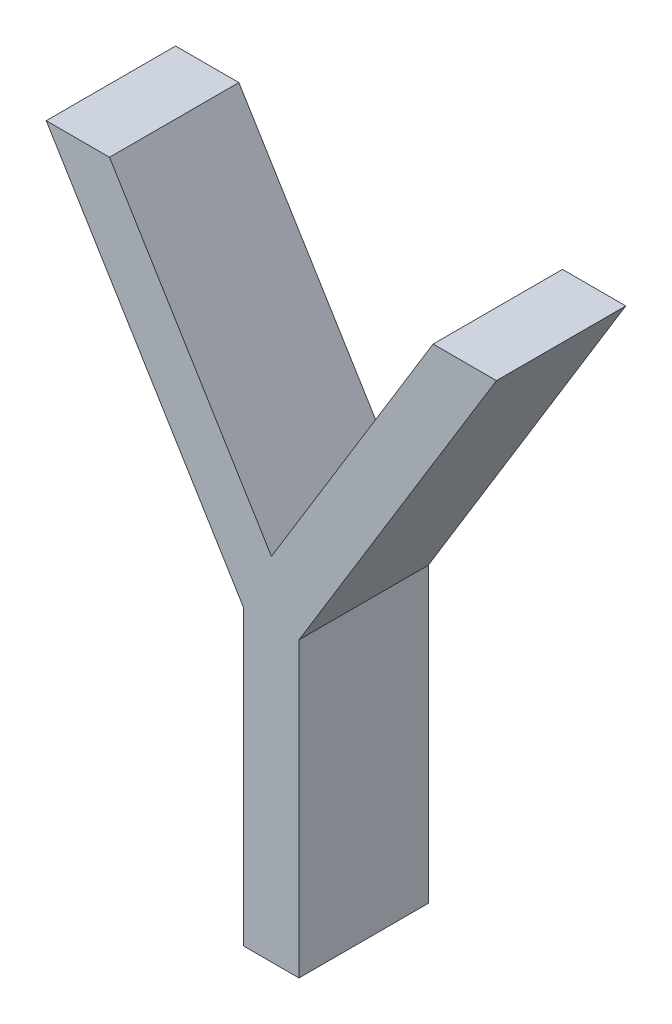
ISO-10303-21;
HEADER;
FILE_DESCRIPTION(('STEP AP214'),'2;1');
FILE_NAME('part.step','',(''),(''),'','','');
FILE_SCHEMA(('AUTOMOTIVE_DESIGN { 1 0 10303 214 1 1 1 1 }'));
ENDSEC;
DATA;
#1=APPLICATION_CONTEXT('core data for automotive mechanical design processes');
#2=APPLICATION_PROTOCOL_DEFINITION('international standard','automotive_design',2000,#1);
#3=PRODUCT_CONTEXT('',#1,'mechanical');
#4=PRODUCT('Part','Part','',(#3));
#5=PRODUCT_RELATED_PRODUCT_CATEGORY('part','',(#4));
#6=PRODUCT_DEFINITION_FORMATION('','',#4);
#7=PRODUCT_DEFINITION_CONTEXT('part definition',#1,'design');
#8=PRODUCT_DEFINITION('design','',#6,#7);
#9=PRODUCT_DEFINITION_SHAPE('','',#8);
#10=(LENGTH_UNIT() NAMED_UNIT(*) SI_UNIT(.MILLI.,.METRE.));
#11=(NAMED_UNIT(*) PLANE_ANGLE_UNIT() SI_UNIT($,.RADIAN.));
#12=(NAMED_UNIT(*) SI_UNIT($,.STERADIAN.) SOLID_ANGLE_UNIT());
#13=UNCERTAINTY_MEASURE_WITH_UNIT(LENGTH_MEASURE(1.E-05),#10,'distance_accuracy_value','');
#14=(GEOMETRIC_REPRESENTATION_CONTEXT(3) GLOBAL_UNCERTAINTY_ASSIGNED_CONTEXT((#13)) GLOBAL_UNIT_ASSIGNED_CONTEXT((#10,
#11,#12)) REPRESENTATION_CONTEXT('',''));
#15=CARTESIAN_POINT('',(0.,0.,0.));
#16=DIRECTION('',(0.,0.,1.));
#17=DIRECTION('',(1.,0.,0.));
#18=AXIS2_PLACEMENT_3D('',#15,#16,#17);
#19=CARTESIAN_POINT('',(192.216794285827,19.3797409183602,2.));
#20=DIRECTION('',(-0.853354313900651,-0.521331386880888,0.));
#21=DIRECTION('',(0.521331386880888,-0.853354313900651,0.));
#22=AXIS2_PLACEMENT_3D('',#19,#20,#21);
#23=PLANE('',#22);
#24=DIRECTION('',(-0.521331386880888,0.853354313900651,0.));
#25=VECTOR('',#24,1.);
#26=CARTESIAN_POINT('',(192.216794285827,19.3797409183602,-2.));
#27=LINE('',#26,#25);
#28=CARTESIAN_POINT('',(192.216794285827,19.3797409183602,-2.));
#29=VERTEX_POINT('',#28);
#30=CARTESIAN_POINT('',(186.111025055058,29.3741219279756,-2.));
#31=VERTEX_POINT('',#30);
#32=EDGE_CURVE('E133',#29,#31,#27,.T.);
#33=ORIENTED_EDGE('',*,*,#32,.F.);
#34=DIRECTION('',(0.,0.,-1.));
#35=VECTOR('',#34,1.);
#36=CARTESIAN_POINT('',(192.216794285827,19.3797409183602,2.));
#37=LINE('',#36,#35);
#38=CARTESIAN_POINT('',(192.216794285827,19.3797409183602,2.));
#39=VERTEX_POINT('',#38);
#40=EDGE_CURVE('E11',#39,#29,#37,.T.);
#41=ORIENTED_EDGE('',*,*,#40,.F.);
#42=DIRECTION('',(-0.521331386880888,0.853354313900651,0.));
#43=VECTOR('',#42,1.);
#44=CARTESIAN_POINT('',(192.216794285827,19.3797409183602,2.));
#45=LINE('',#44,#43);
#46=CARTESIAN_POINT('',(186.111025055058,29.3741219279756,2.));
#47=VERTEX_POINT('',#46);
#48=EDGE_CURVE('E156',#39,#47,#45,.T.);
#49=ORIENTED_EDGE('',*,*,#48,.T.);
#50=DIRECTION('',(0.,0.,-1.));
#51=VECTOR('',#50,1.);
#52=CARTESIAN_POINT('',(186.111025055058,29.3741219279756,2.));
#53=LINE('',#52,#51);
#54=EDGE_CURVE('E33',#47,#31,#53,.T.);
#55=ORIENTED_EDGE('',*,*,#54,.T.);
#56=EDGE_LOOP('',(#33,#41,#49,#55));
#57=FACE_BOUND('',#56,.T.);
#58=ADVANCED_FACE('F30',(#57),#23,.T.);
#59=CARTESIAN_POINT('',(192.216794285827,10.3241219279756,2.));
#60=DIRECTION('',(-1.,0.,0.));
#61=DIRECTION('',(0.,0.,1.));
#62=AXIS2_PLACEMENT_3D('',#59,#60,#61);
#63=PLANE('',#62);
#64=DIRECTION('',(0.,1.,0.));
#65=VECTOR('',#64,1.);
#66=CARTESIAN_POINT('',(192.216794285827,10.3241219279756,-2.));
#67=LINE('',#66,#65);
#68=CARTESIAN_POINT('',(192.216794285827,10.3241219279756,-2.));
#69=VERTEX_POINT('',#68);
#70=EDGE_CURVE('E154',#69,#29,#67,.T.);
#71=ORIENTED_EDGE('',*,*,#70,.F.);
#72=DIRECTION('',(0.,0.,-1.));
#73=VECTOR('',#72,1.);
#74=CARTESIAN_POINT('',(192.216794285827,10.3241219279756,2.));
#75=LINE('',#74,#73);
#76=CARTESIAN_POINT('',(192.216794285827,10.3241219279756,2.));
#77=VERTEX_POINT('',#76);
#78=EDGE_CURVE('E39',#77,#69,#75,.T.);
#79=ORIENTED_EDGE('',*,*,#78,.F.);
#80=DIRECTION('',(0.,1.,0.));
#81=VECTOR('',#80,1.);
#82=CARTESIAN_POINT('',(192.216794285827,10.3241219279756,2.));
#83=LINE('',#82,#81);
#84=EDGE_CURVE('E123',#77,#39,#83,.T.);
#85=ORIENTED_EDGE('',*,*,#84,.T.);
#86=ORIENTED_EDGE('',*,*,#40,.T.);
#87=EDGE_LOOP('',(#71,#79,#85,#86));
#88=FACE_BOUND('',#87,.T.);
#89=ADVANCED_FACE('F170',(#88),#63,.T.);
#90=CARTESIAN_POINT('',(193.926409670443,10.3241219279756,2.));
#91=DIRECTION('',(0.,-1.,0.));
#92=DIRECTION('',(0.,0.,-1.));
#93=AXIS2_PLACEMENT_3D('',#90,#91,#92);
#94=PLANE('',#93);
#95=DIRECTION('',(-1.,0.,0.));
#96=VECTOR('',#95,1.);
#97=CARTESIAN_POINT('',(193.926409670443,10.3241219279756,-2.));
#98=LINE('',#97,#96);
#99=CARTESIAN_POINT('',(193.926409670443,10.3241219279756,-2.));
#100=VERTEX_POINT('',#99);
#101=EDGE_CURVE('E110',#100,#69,#98,.T.);
#102=ORIENTED_EDGE('',*,*,#101,.F.);
#103=DIRECTION('',(0.,0.,-1.));
#104=VECTOR('',#103,1.);
#105=CARTESIAN_POINT('',(193.926409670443,10.3241219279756,2.));
#106=LINE('',#105,#104);
#107=CARTESIAN_POINT('',(193.926409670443,10.3241219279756,2.));
#108=VERTEX_POINT('',#107);
#109=EDGE_CURVE('E105',#108,#100,#106,.T.);
#110=ORIENTED_EDGE('',*,*,#109,.F.);
#111=DIRECTION('',(-1.,0.,0.));
#112=VECTOR('',#111,1.);
#113=CARTESIAN_POINT('',(193.926409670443,10.3241219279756,2.));
#114=LINE('',#113,#112);
#115=EDGE_CURVE('E108',#108,#77,#114,.T.);
#116=ORIENTED_EDGE('',*,*,#115,.T.);
#117=ORIENTED_EDGE('',*,*,#78,.T.);
#118=EDGE_LOOP('',(#102,#110,#116,#117));
#119=FACE_BOUND('',#118,.T.);
#120=ADVANCED_FACE('F107',(#119),#94,.T.);
#121=CARTESIAN_POINT('',(193.926409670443,19.3797409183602,2.));
#122=DIRECTION('',(1.,0.,0.));
#123=DIRECTION('',(0.,0.,-1.));
#124=AXIS2_PLACEMENT_3D('',#121,#122,#123);
#125=PLANE('',#124);
#126=DIRECTION('',(0.,-1.,0.));
#127=VECTOR('',#126,1.);
#128=CARTESIAN_POINT('',(193.926409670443,19.3797409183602,-2.));
#129=LINE('',#128,#127);
#130=CARTESIAN_POINT('',(193.926409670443,19.3797409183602,-2.));
#131=VERTEX_POINT('',#130);
#132=EDGE_CURVE('E151',#131,#100,#129,.T.);
#133=ORIENTED_EDGE('',*,*,#132,.F.);
#134=DIRECTION('',(0.,0.,-1.));
#135=VECTOR('',#134,1.);
#136=CARTESIAN_POINT('',(193.926409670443,19.3797409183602,2.));
#137=LINE('',#136,#135);
#138=CARTESIAN_POINT('',(193.926409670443,19.3797409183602,2.));
#139=VERTEX_POINT('',#138);
#140=EDGE_CURVE('E115',#139,#131,#137,.T.);
#141=ORIENTED_EDGE('',*,*,#140,.F.);
#142=DIRECTION('',(0.,-1.,0.));
#143=VECTOR('',#142,1.);
#144=CARTESIAN_POINT('',(193.926409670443,19.3797409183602,2.));
#145=LINE('',#144,#143);
#146=EDGE_CURVE('E121',#139,#108,#145,.T.);
#147=ORIENTED_EDGE('',*,*,#146,.T.);
#148=ORIENTED_EDGE('',*,*,#109,.T.);
#149=EDGE_LOOP('',(#133,#141,#147,#148));
#150=FACE_BOUND('',#149,.T.);
#151=ADVANCED_FACE('F125',(#150),#125,.T.);
#152=CARTESIAN_POINT('',(200.032178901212,29.3741219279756,2.));
#153=DIRECTION('',(0.853354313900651,-0.521331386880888,0.));
#154=DIRECTION('',(0.521331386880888,0.853354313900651,0.));
#155=AXIS2_PLACEMENT_3D('',#152,#153,#154);
#156=PLANE('',#155);
#157=DIRECTION('',(-0.521331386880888,-0.853354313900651,0.));
#158=VECTOR('',#157,1.);
#159=CARTESIAN_POINT('',(200.032178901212,29.3741219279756,-2.));
#160=LINE('',#159,#158);
#161=CARTESIAN_POINT('',(200.032178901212,29.3741219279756,-2.));
#162=VERTEX_POINT('',#161);
#163=EDGE_CURVE('E148',#162,#131,#160,.T.);
#164=ORIENTED_EDGE('',*,*,#163,.F.);
#165=DIRECTION('',(0.,0.,-1.));
#166=VECTOR('',#165,1.);
#167=CARTESIAN_POINT('',(200.032178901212,29.3741219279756,2.));
#168=LINE('',#167,#166);
#169=CARTESIAN_POINT('',(200.032178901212,29.3741219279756,2.));
#170=VERTEX_POINT('',#169);
#171=EDGE_CURVE('E160',#170,#162,#168,.T.);
#172=ORIENTED_EDGE('',*,*,#171,.F.);
#173=DIRECTION('',(-0.521331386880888,-0.853354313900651,0.));
#174=VECTOR('',#173,1.);
#175=CARTESIAN_POINT('',(200.032178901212,29.3741219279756,2.));
#176=LINE('',#175,#174);
#177=EDGE_CURVE('E126',#170,#139,#176,.T.);
#178=ORIENTED_EDGE('',*,*,#177,.T.);
#179=ORIENTED_EDGE('',*,*,#140,.T.);
#180=EDGE_LOOP('',(#164,#172,#178,#179));
#181=FACE_BOUND('',#180,.T.);
#182=ADVANCED_FACE('F183',(#181),#156,.T.);
#183=CARTESIAN_POINT('',(198.074516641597,29.3741219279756,2.));
#184=DIRECTION('',(0.,1.,0.));
#185=DIRECTION('',(0.,0.,1.));
#186=AXIS2_PLACEMENT_3D('',#183,#184,#185);
#187=PLANE('',#186);
#188=DIRECTION('',(1.,0.,0.));
#189=VECTOR('',#188,1.);
#190=CARTESIAN_POINT('',(198.074516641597,29.3741219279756,-2.));
#191=LINE('',#190,#189);
#192=CARTESIAN_POINT('',(198.074516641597,29.3741219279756,-2.));
#193=VERTEX_POINT('',#192);
#194=EDGE_CURVE('E145',#193,#162,#191,.T.);
#195=ORIENTED_EDGE('',*,*,#194,.F.);
#196=DIRECTION('',(0.,0.,-1.));
#197=VECTOR('',#196,1.);
#198=CARTESIAN_POINT('',(198.074516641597,29.3741219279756,2.));
#199=LINE('',#198,#197);
#200=CARTESIAN_POINT('',(198.074516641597,29.3741219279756,2.));
#201=VERTEX_POINT('',#200);
#202=EDGE_CURVE('E162',#201,#193,#199,.T.);
#203=ORIENTED_EDGE('',*,*,#202,.F.);
#204=DIRECTION('',(1.,0.,0.));
#205=VECTOR('',#204,1.);
#206=CARTESIAN_POINT('',(198.074516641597,29.3741219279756,2.));
#207=LINE('',#206,#205);
#208=EDGE_CURVE('E128',#201,#170,#207,.T.);
#209=ORIENTED_EDGE('',*,*,#208,.T.);
#210=ORIENTED_EDGE('',*,*,#171,.T.);
#211=EDGE_LOOP('',(#195,#203,#209,#210));
#212=FACE_BOUND('',#211,.T.);
#213=ADVANCED_FACE('F186',(#212),#187,.T.);
#214=CARTESIAN_POINT('',(193.075418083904,21.1885750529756,2.));
#215=DIRECTION('',(-0.853429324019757,0.52120858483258,0.));
#216=DIRECTION('',(-0.52120858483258,-0.853429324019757,0.));
#217=AXIS2_PLACEMENT_3D('',#214,#215,#216);
#218=PLANE('',#217);
#219=DIRECTION('',(0.52120858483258,0.853429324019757,0.));
#220=VECTOR('',#219,1.);
#221=CARTESIAN_POINT('',(193.075418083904,21.1885750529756,-2.));
#222=LINE('',#221,#220);
#223=CARTESIAN_POINT('',(193.075418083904,21.1885750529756,-2.));
#224=VERTEX_POINT('',#223);
#225=EDGE_CURVE('E142',#224,#193,#222,.T.);
#226=ORIENTED_EDGE('',*,*,#225,.F.);
#227=DIRECTION('',(0.,0.,-1.));
#228=VECTOR('',#227,1.);
#229=CARTESIAN_POINT('',(193.075418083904,21.1885750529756,2.));
#230=LINE('',#229,#228);
#231=CARTESIAN_POINT('',(193.075418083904,21.1885750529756,2.));
#232=VERTEX_POINT('',#231);
#233=EDGE_CURVE('E164',#232,#224,#230,.T.);
#234=ORIENTED_EDGE('',*,*,#233,.F.);
#235=DIRECTION('',(0.52120858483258,0.853429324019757,0.));
#236=VECTOR('',#235,1.);
#237=CARTESIAN_POINT('',(193.075418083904,21.1885750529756,2.));
#238=LINE('',#237,#236);
#239=EDGE_CURVE('E271',#232,#201,#238,.T.);
#240=ORIENTED_EDGE('',*,*,#239,.T.);
#241=ORIENTED_EDGE('',*,*,#202,.T.);
#242=EDGE_LOOP('',(#226,#234,#240,#241));
#243=FACE_BOUND('',#242,.T.);
#244=ADVANCED_FACE('F190',(#243),#218,.T.);
#245=CARTESIAN_POINT('',(188.068687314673,29.3741219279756,2.));
#246=DIRECTION('',(0.853075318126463,0.521787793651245,0.));
#247=DIRECTION('',(-0.521787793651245,0.853075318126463,0.));
#248=AXIS2_PLACEMENT_3D('',#245,#246,#247);
#249=PLANE('',#248);
#250=DIRECTION('',(0.521787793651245,-0.853075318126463,0.));
#251=VECTOR('',#250,1.);
#252=CARTESIAN_POINT('',(188.068687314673,29.3741219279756,-2.));
#253=LINE('',#252,#251);
#254=CARTESIAN_POINT('',(188.068687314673,29.3741219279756,-2.));
#255=VERTEX_POINT('',#254);
#256=EDGE_CURVE('E139',#255,#224,#253,.T.);
#257=ORIENTED_EDGE('',*,*,#256,.F.);
#258=DIRECTION('',(0.,0.,-1.));
#259=VECTOR('',#258,1.);
#260=CARTESIAN_POINT('',(188.068687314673,29.3741219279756,2.));
#261=LINE('',#260,#259);
#262=CARTESIAN_POINT('',(188.068687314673,29.3741219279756,2.));
#263=VERTEX_POINT('',#262);
#264=EDGE_CURVE('E165',#263,#255,#261,.T.);
#265=ORIENTED_EDGE('',*,*,#264,.F.);
#266=DIRECTION('',(0.521787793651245,-0.853075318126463,0.));
#267=VECTOR('',#266,1.);
#268=CARTESIAN_POINT('',(188.068687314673,29.3741219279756,2.));
#269=LINE('',#268,#267);
#270=EDGE_CURVE('E275',#263,#232,#269,.T.);
#271=ORIENTED_EDGE('',*,*,#270,.T.);
#272=ORIENTED_EDGE('',*,*,#233,.T.);
#273=EDGE_LOOP('',(#257,#265,#271,#272));
#274=FACE_BOUND('',#273,.T.);
#275=ADVANCED_FACE('F194',(#274),#249,.T.);
#276=CARTESIAN_POINT('',(186.111025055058,29.3741219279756,2.));
#277=DIRECTION('',(0.,1.,0.));
#278=DIRECTION('',(0.,0.,1.));
#279=AXIS2_PLACEMENT_3D('',#276,#277,#278);
#280=PLANE('',#279);
#281=DIRECTION('',(1.,0.,0.));
#282=VECTOR('',#281,1.);
#283=CARTESIAN_POINT('',(186.111025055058,29.3741219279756,-2.));
#284=LINE('',#283,#282);
#285=EDGE_CURVE('E136',#31,#255,#284,.T.);
#286=ORIENTED_EDGE('',*,*,#285,.F.);
#287=ORIENTED_EDGE('',*,*,#54,.F.);
#288=DIRECTION('',(1.,0.,0.));
#289=VECTOR('',#288,1.);
#290=CARTESIAN_POINT('',(186.111025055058,29.3741219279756,2.));
#291=LINE('',#290,#289);
#292=EDGE_CURVE('E279',#47,#263,#291,.T.);
#293=ORIENTED_EDGE('',*,*,#292,.T.);
#294=ORIENTED_EDGE('',*,*,#264,.T.);
#295=EDGE_LOOP('',(#286,#287,#293,#294));
#296=FACE_BOUND('',#295,.T.);
#297=ADVANCED_FACE('F167',(#296),#280,.T.);
#298=CARTESIAN_POINT('',(193.071601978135,17.9805275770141,2.));
#299=DIRECTION('',(0.,0.,1.));
#300=DIRECTION('',(1.,0.,0.));
#301=AXIS2_PLACEMENT_3D('',#298,#299,#300);
#302=PLANE('',#301);
#303=ORIENTED_EDGE('',*,*,#48,.F.);
#304=ORIENTED_EDGE('',*,*,#84,.F.);
#305=ORIENTED_EDGE('',*,*,#115,.F.);
#306=ORIENTED_EDGE('',*,*,#146,.F.);
#307=ORIENTED_EDGE('',*,*,#177,.F.);
#308=ORIENTED_EDGE('',*,*,#208,.F.);
#309=ORIENTED_EDGE('',*,*,#239,.F.);
#310=ORIENTED_EDGE('',*,*,#270,.F.);
#311=ORIENTED_EDGE('',*,*,#292,.F.);
#312=EDGE_LOOP('',(#303,#304,#305,#306,#307,#308,#309,#310,#311));
#313=FACE_BOUND('',#312,.T.);
#314=ADVANCED_FACE('F119',(#313),#302,.T.);
#315=CARTESIAN_POINT('',(193.071601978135,17.9805275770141,-2.));
#316=DIRECTION('',(0.,0.,1.));
#317=DIRECTION('',(1.,0.,0.));
#318=AXIS2_PLACEMENT_3D('',#315,#316,#317);
#319=PLANE('',#318);
#320=ORIENTED_EDGE('',*,*,#32,.T.);
#321=ORIENTED_EDGE('',*,*,#285,.T.);
#322=ORIENTED_EDGE('',*,*,#256,.T.);
#323=ORIENTED_EDGE('',*,*,#225,.T.);
#324=ORIENTED_EDGE('',*,*,#194,.T.);
#325=ORIENTED_EDGE('',*,*,#163,.T.);
#326=ORIENTED_EDGE('',*,*,#132,.T.);
#327=ORIENTED_EDGE('',*,*,#101,.T.);
#328=ORIENTED_EDGE('',*,*,#70,.T.);
#329=EDGE_LOOP('',(#320,#321,#322,#323,#324,#325,#326,#327,#328));
#330=FACE_BOUND('',#329,.T.);
#331=ADVANCED_FACE('F169',(#330),#319,.F.);
#332=CLOSED_SHELL('',(#58,#89,#120,#151,#182,#213,#244,#275,#297,#314,#331));
#333=MANIFOLD_SOLID_BREP('B2',#332);
#334=ADVANCED_BREP_SHAPE_REPRESENTATION('',(#18,#333),#14);
#335=SHAPE_DEFINITION_REPRESENTATION(#9,#334);
ENDSEC;
END-ISO-10303-21;
